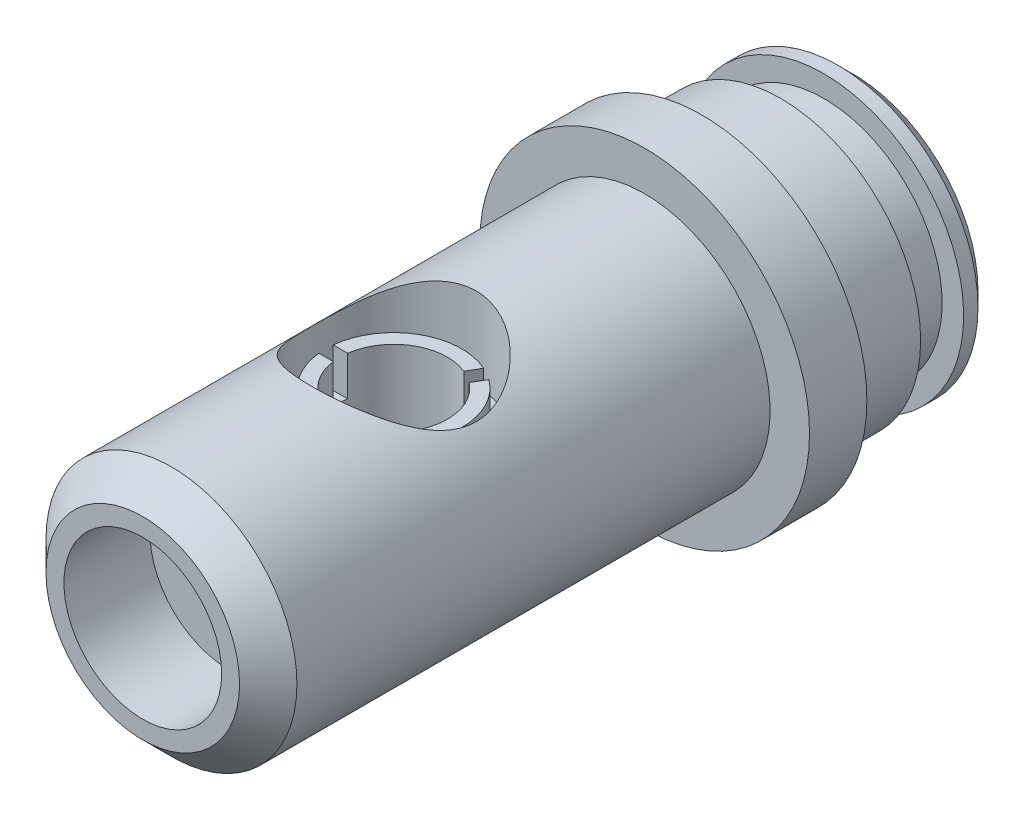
ISO-10303-21;
HEADER;
FILE_DESCRIPTION(('STEP AP214'),'2;1');
FILE_NAME('part.step','',(''),(''),'','','');
FILE_SCHEMA(('AUTOMOTIVE_DESIGN { 1 0 10303 214 1 1 1 1 }'));
ENDSEC;
DATA;
#1=APPLICATION_CONTEXT('core data for automotive mechanical design processes');
#2=APPLICATION_PROTOCOL_DEFINITION('international standard','automotive_design',2000,#1);
#3=PRODUCT_CONTEXT('',#1,'mechanical');
#4=PRODUCT('Part','Part','',(#3));
#5=PRODUCT_RELATED_PRODUCT_CATEGORY('part','',(#4));
#6=PRODUCT_DEFINITION_FORMATION('','',#4);
#7=PRODUCT_DEFINITION_CONTEXT('part definition',#1,'design');
#8=PRODUCT_DEFINITION('design','',#6,#7);
#9=PRODUCT_DEFINITION_SHAPE('','',#8);
#10=(LENGTH_UNIT() NAMED_UNIT(*) SI_UNIT(.MILLI.,.METRE.));
#11=(NAMED_UNIT(*) PLANE_ANGLE_UNIT() SI_UNIT($,.RADIAN.));
#12=(NAMED_UNIT(*) SI_UNIT($,.STERADIAN.) SOLID_ANGLE_UNIT());
#13=UNCERTAINTY_MEASURE_WITH_UNIT(LENGTH_MEASURE(1.E-05),#10,'distance_accuracy_value','');
#14=(GEOMETRIC_REPRESENTATION_CONTEXT(3) GLOBAL_UNCERTAINTY_ASSIGNED_CONTEXT((#13)) GLOBAL_UNIT_ASSIGNED_CONTEXT((#10,
#11,#12)) REPRESENTATION_CONTEXT('',''));
#15=CARTESIAN_POINT('',(0.,0.,0.));
#16=DIRECTION('',(0.,0.,1.));
#17=DIRECTION('',(1.,0.,0.));
#18=AXIS2_PLACEMENT_3D('',#15,#16,#17);
#19=CARTESIAN_POINT('',(0.,-100.,17.5));
#20=DIRECTION('',(0.,1.,0.));
#21=DIRECTION('',(0.,0.,1.));
#22=AXIS2_PLACEMENT_3D('',#19,#20,#21);
#23=CYLINDRICAL_SURFACE('',#22,3.75);
#24=CARTESIAN_POINT('',(0.,-8.75,21.25));
#25=CARTESIAN_POINT('',(0.100227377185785,-8.7499993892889,21.2499992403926));
#26=CARTESIAN_POINT('',(0.200485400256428,-8.74827314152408,21.2459761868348));
#27=CARTESIAN_POINT('',(0.400282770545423,-8.7414117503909,21.2299235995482));
#28=CARTESIAN_POINT('',(0.49982164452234,-8.73627453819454,21.2178892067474));
#29=CARTESIAN_POINT('',(0.69760374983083,-8.72271089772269,21.1859052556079));
#30=CARTESIAN_POINT('',(0.795844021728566,-8.7142779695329,21.1659400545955));
#31=CARTESIAN_POINT('',(0.990134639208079,-8.69434863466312,21.1183087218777));
#32=CARTESIAN_POINT('',(1.08618407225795,-8.68285097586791,21.0906394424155));
#33=CARTESIAN_POINT('',(1.3693125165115,-8.64427691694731,20.996689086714));
#34=CARTESIAN_POINT('',(1.55228472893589,-8.61305280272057,20.9193153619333));
#35=CARTESIAN_POINT('',(1.90236984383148,-8.54256906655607,20.7376630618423));
#36=CARTESIAN_POINT('',(2.06948702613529,-8.50331162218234,20.6333917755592));
#37=CARTESIAN_POINT('',(2.3922945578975,-8.41834800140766,20.3950897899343));
#38=CARTESIAN_POINT('',(2.54705184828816,-8.37242278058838,20.2598712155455));
#39=CARTESIAN_POINT('',(2.83248672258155,-8.28022159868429,19.9660798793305));
#40=CARTESIAN_POINT('',(2.9631509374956,-8.2339454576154,19.8074942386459));
#41=CARTESIAN_POINT('',(3.2035841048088,-8.14352157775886,19.461168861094));
#42=CARTESIAN_POINT('',(3.31188721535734,-8.09961488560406,19.272332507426));
#43=CARTESIAN_POINT('',(3.44900380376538,-8.04172417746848,18.9760651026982));
#44=CARTESIAN_POINT('',(3.49049730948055,-8.0237501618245,18.8750994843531));
#45=CARTESIAN_POINT('',(3.56465100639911,-7.99108303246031,18.6694795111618));
#46=CARTESIAN_POINT('',(3.59731581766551,-7.97638820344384,18.5648271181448));
#47=CARTESIAN_POINT('',(3.65203947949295,-7.9514757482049,18.3578992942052));
#48=CARTESIAN_POINT('',(3.67454443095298,-7.94107203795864,18.2557638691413));
#49=CARTESIAN_POINT('',(3.71096608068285,-7.92411735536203,18.0496994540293));
#50=CARTESIAN_POINT('',(3.72488681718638,-7.91756457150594,17.9457713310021));
#51=CARTESIAN_POINT('',(3.74397306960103,-7.90855725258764,17.7369672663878));
#52=CARTESIAN_POINT('',(3.74914116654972,-7.90610150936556,17.6320916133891));
#53=CARTESIAN_POINT('',(3.75066184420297,-7.90538023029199,17.4222664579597));
#54=CARTESIAN_POINT('',(3.74701493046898,-7.90711445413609,17.3173169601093));
#55=CARTESIAN_POINT('',(3.73161527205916,-7.91439277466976,17.1168517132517));
#56=CARTESIAN_POINT('',(3.72055440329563,-7.91961154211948,17.0212704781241));
#57=CARTESIAN_POINT('',(3.69117754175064,-7.93334495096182,16.8314590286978));
#58=CARTESIAN_POINT('',(3.67285907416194,-7.94186071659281,16.7372292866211));
#59=CARTESIAN_POINT('',(3.60727391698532,-7.97197945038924,16.4575723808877));
#60=CARTESIAN_POINT('',(3.54936451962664,-7.99816050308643,16.275013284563));
#61=CARTESIAN_POINT('',(3.40571679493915,-8.06038376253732,15.9184115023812));
#62=CARTESIAN_POINT('',(3.31939862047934,-8.09662874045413,15.7446416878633));
#63=CARTESIAN_POINT('',(3.12177987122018,-8.17485612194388,15.4133250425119));
#64=CARTESIAN_POINT('',(3.01046913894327,-8.21684085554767,15.2557848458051));
#65=CARTESIAN_POINT('',(2.754292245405,-8.30640507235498,14.946525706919));
#66=CARTESIAN_POINT('',(2.60730902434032,-8.35414819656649,14.7966034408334));
#67=CARTESIAN_POINT('',(2.28984174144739,-8.44668256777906,14.522911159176));
#68=CARTESIAN_POINT('',(2.11935154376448,-8.49147303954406,14.3991479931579));
#69=CARTESIAN_POINT('',(1.75398225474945,-8.574496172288,14.1784449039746));
#70=CARTESIAN_POINT('',(1.55858893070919,-8.61253068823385,14.0822761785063));
#71=CARTESIAN_POINT('',(1.15234962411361,-8.67621745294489,13.9248122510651));
#72=CARTESIAN_POINT('',(0.941512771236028,-8.70187695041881,13.8634966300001));
#73=CARTESIAN_POINT('',(0.525345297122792,-8.73654408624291,13.7813326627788));
#74=CARTESIAN_POINT('',(0.320572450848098,-8.74654062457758,13.7580765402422));
#75=CARTESIAN_POINT('',(-0.0901791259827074,-8.75194270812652,13.7454630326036));
#76=CARTESIAN_POINT('',(-0.296157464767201,-8.74735275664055,13.7560951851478));
#77=CARTESIAN_POINT('',(-0.691928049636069,-8.72473345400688,13.8092695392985));
#78=CARTESIAN_POINT('',(-0.88199866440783,-8.70743149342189,13.8500854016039));
#79=CARTESIAN_POINT('',(-1.25236392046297,-8.66192360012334,13.9600261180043));
#80=CARTESIAN_POINT('',(-1.43265734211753,-8.63371631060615,14.0291544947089));
#81=CARTESIAN_POINT('',(-1.78472120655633,-8.56798439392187,14.1960014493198));
#82=CARTESIAN_POINT('',(-1.95604968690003,-8.53019631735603,14.294545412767));
#83=CARTESIAN_POINT('',(-2.28035613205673,-8.44928735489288,14.5165236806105));
#84=CARTESIAN_POINT('',(-2.43332621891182,-8.40616419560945,14.6399686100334));
#85=CARTESIAN_POINT('',(-2.72870949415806,-8.31518485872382,14.919111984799));
#86=CARTESIAN_POINT('',(-2.86945771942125,-8.2672169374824,15.0765402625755));
#87=CARTESIAN_POINT('',(-3.12304289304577,-8.17480047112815,15.4134778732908));
#88=CARTESIAN_POINT('',(-3.23587208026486,-8.13035290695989,15.5929933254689));
#89=CARTESIAN_POINT('',(-3.43204844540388,-8.04953711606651,15.9735173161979));
#90=CARTESIAN_POINT('',(-3.51483018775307,-8.01332819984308,16.1748537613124));
#91=CARTESIAN_POINT('',(-3.64457356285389,-7.95517009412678,16.5906579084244));
#92=CARTESIAN_POINT('',(-3.6915670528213,-7.93320822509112,16.8051137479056));
#93=CARTESIAN_POINT('',(-3.74514935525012,-7.90804351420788,17.2224889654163));
#94=CARTESIAN_POINT('',(-3.75468366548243,-7.90347407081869,17.4249490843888));
#95=CARTESIAN_POINT('',(-3.74103311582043,-7.90994522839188,17.8284871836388));
#96=CARTESIAN_POINT('',(-3.71785402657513,-7.92098307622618,18.0295654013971));
#97=CARTESIAN_POINT('',(-3.64195539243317,-7.95614567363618,18.4138021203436));
#98=CARTESIAN_POINT('',(-3.59083719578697,-7.97955891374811,18.5973484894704));
#99=CARTESIAN_POINT('',(-3.46212777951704,-8.03623594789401,18.9532759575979));
#100=CARTESIAN_POINT('',(-3.38452903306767,-8.06950254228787,19.1256538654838));
#101=CARTESIAN_POINT('',(-3.19954063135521,-8.14469059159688,19.4660258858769));
#102=CARTESIAN_POINT('',(-3.09060290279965,-8.18702061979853,19.6330864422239));
#103=CARTESIAN_POINT('',(-2.84812001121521,-8.27449723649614,19.947477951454));
#104=CARTESIAN_POINT('',(-2.71456554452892,-8.31964488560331,20.0948014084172));
#105=CARTESIAN_POINT('',(-2.41418811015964,-8.41194280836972,20.3775045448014));
#106=CARTESIAN_POINT('',(-2.24557156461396,-8.45896999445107,20.5110244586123));
#107=CARTESIAN_POINT('',(-1.88649699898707,-8.54620596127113,20.7480496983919));
#108=CARTESIAN_POINT('',(-1.69602913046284,-8.58641164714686,20.8515414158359));
#109=CARTESIAN_POINT('',(-1.39943164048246,-8.63794303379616,20.9807408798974));
#110=CARTESIAN_POINT('',(-1.29946606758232,-8.65357999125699,21.0192916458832));
#111=CARTESIAN_POINT('',(-1.09621341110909,-8.68166502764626,21.0877977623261));
#112=CARTESIAN_POINT('',(-0.992927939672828,-8.69411462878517,21.1177572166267));
#113=CARTESIAN_POINT('',(-0.784082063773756,-8.71542974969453,21.1686846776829));
#114=CARTESIAN_POINT('',(-0.678527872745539,-8.72430400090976,21.189674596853));
#115=CARTESIAN_POINT('',(-0.465809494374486,-8.7382414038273,21.222510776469));
#116=CARTESIAN_POINT('',(-0.358646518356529,-8.74330728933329,21.2343635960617));
#117=CARTESIAN_POINT('',(-0.209366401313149,-8.74759504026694,21.2443855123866));
#118=CARTESIAN_POINT('',(-0.167527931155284,-8.74849631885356,21.2464902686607));
#119=CARTESIAN_POINT('',(-0.0837947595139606,-8.74969892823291,21.2492976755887));
#120=CARTESIAN_POINT('',(-0.0419000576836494,-8.75000025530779,21.2500003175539));
#121=CARTESIAN_POINT('',(0.,-8.75,21.25));
#122=B_SPLINE_CURVE_WITH_KNOTS('',3,(#24,#25,#26,#27,#28,#29,#30,#31,#32,#33,#34,#35,#36,#37,
#38,#39,#40,#41,#42,#43,#44,#45,#46,#47,#48,#49,#50,#51,#52,#53,#54,#55,#56,#57,#58,#59,#60,#61,
#62,#63,#64,#65,#66,#67,#68,#69,#70,#71,#72,#73,#74,#75,#76,#77,#78,#79,#80,#81,#82,#83,#84,#85,
#86,#87,#88,#89,#90,#91,#92,#93,#94,#95,#96,#97,#98,#99,#100,#101,#102,#103,#104,#105,#106,#107,
#108,#109,#110,#111,#112,#113,#114,#115,#116,#117,#118,#119,#120,#121),.UNSPECIFIED.,.T.,.F.,(4,
2,2,2,2,2,2,2,2,2,2,2,2,2,2,2,2,2,2,2,2,2,2,2,2,2,2,2,2,2,2,2,2,2,2,2,2,2,2,2,2,2,2,2,2,2,2,2,
4),(0.,0.300639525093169,0.601461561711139,0.902879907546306,1.20442158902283,1.80475703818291,
2.40492997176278,3.03390100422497,3.66322000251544,4.32573622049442,4.65724736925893,
4.98858470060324,5.30346943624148,5.6182059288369,5.93284959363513,6.24747521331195,
6.53620481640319,6.82503295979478,7.40220068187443,7.99196656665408,8.58197257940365,
9.22502192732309,9.86823944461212,10.5279895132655,11.1873526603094,11.8031157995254,
12.4186888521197,13.0015388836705,13.5844614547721,14.1855871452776,14.7869698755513,
15.4336845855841,16.0805788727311,16.7390825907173,17.3969994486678,18.0020050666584,
18.6069039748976,19.1802995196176,19.7538581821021,20.362958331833,20.9722891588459,
21.629701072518,22.2874104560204,22.6118791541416,22.9361926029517,23.2597091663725,
23.5829932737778,23.708674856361,23.8343572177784),.UNSPECIFIED.);
#123=CARTESIAN_POINT('',(0.,-8.75,21.25));
#124=VERTEX_POINT('',#123);
#125=EDGE_CURVE('E271',#124,#124,#122,.T.);
#126=ORIENTED_EDGE('',*,*,#125,.F.);
#127=EDGE_LOOP('',(#126));
#128=FACE_BOUND('',#127,.T.);
#129=DIRECTION('',(0.,1.,0.));
#130=VECTOR('',#129,1.);
#131=CARTESIAN_POINT('',(2.29127129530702,-100.,20.4685982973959));
#132=LINE('',#131,#130);
#133=CARTESIAN_POINT('',(2.29127129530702,5.75000000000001,20.4685982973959));
#134=VERTEX_POINT('',#133);
#135=CARTESIAN_POINT('',(2.29127129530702,3.,20.4685982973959));
#136=VERTEX_POINT('',#135);
#137=EDGE_CURVE('E219',#134,#136,#132,.F.);
#138=ORIENTED_EDGE('',*,*,#137,.F.);
#139=CARTESIAN_POINT('',(0.,5.75000000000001,17.5));
#140=DIRECTION('',(0.,1.,0.));
#141=DIRECTION('',(0.,0.,1.));
#142=AXIS2_PLACEMENT_3D('',#139,#140,#141);
#143=CIRCLE('',#142,3.75);
#144=CARTESIAN_POINT('',(2.29127129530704,5.75000000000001,14.5314017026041));
#145=VERTEX_POINT('',#144);
#146=EDGE_CURVE('E163',#145,#134,#143,.F.);
#147=ORIENTED_EDGE('',*,*,#146,.F.);
#148=DIRECTION('',(0.,1.,0.));
#149=VECTOR('',#148,1.);
#150=CARTESIAN_POINT('',(2.29127129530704,-100.,14.5314017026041));
#151=LINE('',#150,#149);
#152=CARTESIAN_POINT('',(2.29127129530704,3.,14.5314017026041));
#153=VERTEX_POINT('',#152);
#154=EDGE_CURVE('E56',#153,#145,#151,.T.);
#155=ORIENTED_EDGE('',*,*,#154,.F.);
#156=CARTESIAN_POINT('',(0.,3.,17.5));
#157=DIRECTION('',(0.,-1.,0.));
#158=DIRECTION('',(0.,0.,-1.));
#159=AXIS2_PLACEMENT_3D('',#156,#157,#158);
#160=CIRCLE('',#159,3.75);
#161=CARTESIAN_POINT('',(1.4252458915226,3.,14.0314017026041));
#162=VERTEX_POINT('',#161);
#163=EDGE_CURVE('E199',#153,#162,#160,.F.);
#164=ORIENTED_EDGE('',*,*,#163,.T.);
#165=DIRECTION('',(0.,1.,0.));
#166=VECTOR('',#165,1.);
#167=CARTESIAN_POINT('',(1.4252458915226,-100.,14.0314017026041));
#168=LINE('',#167,#166);
#169=CARTESIAN_POINT('',(1.4252458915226,5.75000000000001,14.0314017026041));
#170=VERTEX_POINT('',#169);
#171=EDGE_CURVE('E202',#170,#162,#168,.F.);
#172=ORIENTED_EDGE('',*,*,#171,.F.);
#173=CARTESIAN_POINT('',(-3.71651718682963,5.75000000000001,17.));
#174=VERTEX_POINT('',#173);
#175=EDGE_CURVE('E156',#174,#170,#143,.F.);
#176=ORIENTED_EDGE('',*,*,#175,.F.);
#177=DIRECTION('',(0.,1.,0.));
#178=VECTOR('',#177,1.);
#179=CARTESIAN_POINT('',(-3.71651718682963,-100.,17.));
#180=LINE('',#179,#178);
#181=CARTESIAN_POINT('',(-3.71651718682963,3.,17.));
#182=VERTEX_POINT('',#181);
#183=EDGE_CURVE('E190',#182,#174,#180,.T.);
#184=ORIENTED_EDGE('',*,*,#183,.F.);
#185=CARTESIAN_POINT('',(0.,3.,17.5));
#186=DIRECTION('',(0.,-1.,0.));
#187=DIRECTION('',(0.,0.,-1.));
#188=AXIS2_PLACEMENT_3D('',#185,#186,#187);
#189=CIRCLE('',#188,3.75);
#190=CARTESIAN_POINT('',(-3.71651718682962,3.,18.));
#191=VERTEX_POINT('',#190);
#192=EDGE_CURVE('E179',#182,#191,#189,.F.);
#193=ORIENTED_EDGE('',*,*,#192,.T.);
#194=DIRECTION('',(0.,1.,0.));
#195=VECTOR('',#194,1.);
#196=CARTESIAN_POINT('',(-3.71651718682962,-100.,18.));
#197=LINE('',#196,#195);
#198=CARTESIAN_POINT('',(-3.71651718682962,5.75000000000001,18.));
#199=VERTEX_POINT('',#198);
#200=EDGE_CURVE('E183',#199,#191,#197,.F.);
#201=ORIENTED_EDGE('',*,*,#200,.F.);
#202=CARTESIAN_POINT('',(1.42524589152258,5.75000000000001,20.9685982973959));
#203=VERTEX_POINT('',#202);
#204=EDGE_CURVE('E164',#203,#199,#143,.F.);
#205=ORIENTED_EDGE('',*,*,#204,.F.);
#206=DIRECTION('',(0.,1.,0.));
#207=VECTOR('',#206,1.);
#208=CARTESIAN_POINT('',(1.42524589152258,-100.,20.9685982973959));
#209=LINE('',#208,#207);
#210=CARTESIAN_POINT('',(1.42524589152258,3.,20.9685982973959));
#211=VERTEX_POINT('',#210);
#212=EDGE_CURVE('E48',#211,#203,#209,.T.);
#213=ORIENTED_EDGE('',*,*,#212,.F.);
#214=CARTESIAN_POINT('',(0.,3.,17.5));
#215=DIRECTION('',(0.,-1.,0.));
#216=DIRECTION('',(0.,0.,-1.));
#217=AXIS2_PLACEMENT_3D('',#214,#215,#216);
#218=CIRCLE('',#217,3.75);
#219=EDGE_CURVE('E142',#211,#136,#218,.F.);
#220=ORIENTED_EDGE('',*,*,#219,.T.);
#221=EDGE_LOOP('',(#138,#147,#155,#164,#172,#176,#184,#193,#201,#205,#213,#220));
#222=FACE_BOUND('',#221,.T.);
#223=ADVANCED_FACE('F32',(#128,#222),#23,.F.);
#224=CARTESIAN_POINT('',(0.,13.,17.5));
#225=DIRECTION('',(0.,-1.,0.));
#226=DIRECTION('',(0.,0.,-1.));
#227=AXIS2_PLACEMENT_3D('',#224,#225,#226);
#228=CYLINDRICAL_SURFACE('',#227,4.75);
#229=DIRECTION('',(0.,-1.,0.));
#230=VECTOR('',#229,1.);
#231=CARTESIAN_POINT('',(2.79481815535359,13.,21.3407670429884));
#232=LINE('',#231,#230);
#233=CARTESIAN_POINT('',(2.79481815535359,3.,21.3407670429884));
#234=VERTEX_POINT('',#233);
#235=CARTESIAN_POINT('',(2.79481815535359,5.75,21.3407670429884));
#236=VERTEX_POINT('',#235);
#237=EDGE_CURVE('E221',#234,#236,#232,.F.);
#238=ORIENTED_EDGE('',*,*,#237,.F.);
#239=CARTESIAN_POINT('',(0.,3.,17.5));
#240=DIRECTION('',(0.,1.,0.));
#241=DIRECTION('',(-1.,0.,0.));
#242=AXIS2_PLACEMENT_3D('',#239,#240,#241);
#243=CIRCLE('',#242,4.75);
#244=CARTESIAN_POINT('',(2.79481815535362,3.,13.6592329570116));
#245=VERTEX_POINT('',#244);
#246=EDGE_CURVE('E149',#234,#245,#243,.T.);
#247=ORIENTED_EDGE('',*,*,#246,.T.);
#248=DIRECTION('',(0.,-1.,0.));
#249=VECTOR('',#248,1.);
#250=CARTESIAN_POINT('',(2.79481815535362,13.,13.6592329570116));
#251=LINE('',#250,#249);
#252=CARTESIAN_POINT('',(2.79481815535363,5.75,13.6592329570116));
#253=VERTEX_POINT('',#252);
#254=EDGE_CURVE('E209',#253,#245,#251,.T.);
#255=ORIENTED_EDGE('',*,*,#254,.F.);
#256=CARTESIAN_POINT('',(0.,5.75,17.5));
#257=DIRECTION('',(0.,1.,0.));
#258=DIRECTION('',(0.,0.,1.));
#259=AXIS2_PLACEMENT_3D('',#256,#257,#258);
#260=CIRCLE('',#259,4.75);
#261=EDGE_CURVE('E175',#236,#253,#260,.T.);
#262=ORIENTED_EDGE('',*,*,#261,.F.);
#263=EDGE_LOOP('',(#238,#247,#255,#262));
#264=FACE_BOUND('',#263,.T.);
#265=ADVANCED_FACE('F234',(#264),#228,.T.);
#266=DIRECTION('',(0.,-1.,0.));
#267=VECTOR('',#266,1.);
#268=CARTESIAN_POINT('',(1.92879275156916,13.,21.8407670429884));
#269=LINE('',#268,#267);
#270=CARTESIAN_POINT('',(1.92879275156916,5.75,21.8407670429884));
#271=VERTEX_POINT('',#270);
#272=CARTESIAN_POINT('',(1.92879275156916,3.,21.8407670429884));
#273=VERTEX_POINT('',#272);
#274=EDGE_CURVE('E123',#271,#273,#269,.T.);
#275=ORIENTED_EDGE('',*,*,#274,.F.);
#276=CARTESIAN_POINT('',(-4.7236109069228,5.75,18.));
#277=VERTEX_POINT('',#276);
#278=EDGE_CURVE('E171',#277,#271,#260,.T.);
#279=ORIENTED_EDGE('',*,*,#278,.F.);
#280=DIRECTION('',(0.,-1.,0.));
#281=VECTOR('',#280,1.);
#282=CARTESIAN_POINT('',(-4.7236109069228,13.,18.));
#283=LINE('',#282,#281);
#284=CARTESIAN_POINT('',(-4.7236109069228,3.,18.));
#285=VERTEX_POINT('',#284);
#286=EDGE_CURVE('E147',#285,#277,#283,.F.);
#287=ORIENTED_EDGE('',*,*,#286,.F.);
#288=EDGE_CURVE('E139',#285,#273,#243,.T.);
#289=ORIENTED_EDGE('',*,*,#288,.T.);
#290=EDGE_LOOP('',(#275,#279,#287,#289));
#291=FACE_BOUND('',#290,.T.);
#292=ADVANCED_FACE('F146',(#291),#228,.T.);
#293=CARTESIAN_POINT('',(0.,5.75,17.5));
#294=DIRECTION('',(0.,1.,0.));
#295=DIRECTION('',(0.,0.,1.));
#296=AXIS2_PLACEMENT_3D('',#293,#294,#295);
#297=PLANE('',#296);
#298=ORIENTED_EDGE('',*,*,#146,.T.);
#299=DIRECTION('',(0.499999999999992,0.,0.866025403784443));
#300=VECTOR('',#299,1.);
#301=CARTESIAN_POINT('',(0.433012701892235,5.75,17.25));
#302=LINE('',#301,#300);
#303=EDGE_CURVE('E223',#134,#236,#302,.T.);
#304=ORIENTED_EDGE('',*,*,#303,.T.);
#305=ORIENTED_EDGE('',*,*,#261,.T.);
#306=DIRECTION('',(-0.500000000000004,0.,0.866025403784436));
#307=VECTOR('',#306,1.);
#308=CARTESIAN_POINT('',(0.433012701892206,5.75,17.75));
#309=LINE('',#308,#307);
#310=EDGE_CURVE('E212',#253,#145,#309,.T.);
#311=ORIENTED_EDGE('',*,*,#310,.T.);
#312=EDGE_LOOP('',(#298,#304,#305,#311));
#313=FACE_BOUND('',#312,.T.);
#314=ADVANCED_FACE('F242',(#313),#297,.T.);
#315=ORIENTED_EDGE('',*,*,#278,.T.);
#316=DIRECTION('',(-0.499999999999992,0.,-0.866025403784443));
#317=VECTOR('',#316,1.);
#318=CARTESIAN_POINT('',(-0.433012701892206,5.75,17.75));
#319=LINE('',#318,#317);
#320=EDGE_CURVE('E127',#271,#203,#319,.T.);
#321=ORIENTED_EDGE('',*,*,#320,.T.);
#322=ORIENTED_EDGE('',*,*,#204,.T.);
#323=DIRECTION('',(-1.,0.,0.));
#324=VECTOR('',#323,1.);
#325=CARTESIAN_POINT('',(0.,5.75,18.));
#326=LINE('',#325,#324);
#327=EDGE_CURVE('E12',#199,#277,#326,.T.);
#328=ORIENTED_EDGE('',*,*,#327,.T.);
#329=EDGE_LOOP('',(#315,#321,#322,#328));
#330=FACE_BOUND('',#329,.T.);
#331=ADVANCED_FACE('F244',(#330),#297,.T.);
#332=DIRECTION('',(0.,-1.,0.));
#333=VECTOR('',#332,1.);
#334=CARTESIAN_POINT('',(1.92879275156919,13.,13.1592329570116));
#335=LINE('',#334,#333);
#336=CARTESIAN_POINT('',(1.92879275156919,3.,13.1592329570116));
#337=VERTEX_POINT('',#336);
#338=CARTESIAN_POINT('',(1.92879275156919,5.75,13.1592329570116));
#339=VERTEX_POINT('',#338);
#340=EDGE_CURVE('E204',#337,#339,#335,.F.);
#341=ORIENTED_EDGE('',*,*,#340,.F.);
#342=CARTESIAN_POINT('',(-4.7236109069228,3.,17.));
#343=VERTEX_POINT('',#342);
#344=EDGE_CURVE('E151',#337,#343,#243,.T.);
#345=ORIENTED_EDGE('',*,*,#344,.T.);
#346=DIRECTION('',(0.,-1.,0.));
#347=VECTOR('',#346,1.);
#348=CARTESIAN_POINT('',(-4.7236109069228,13.,17.));
#349=LINE('',#348,#347);
#350=CARTESIAN_POINT('',(-4.7236109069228,5.75,17.));
#351=VERTEX_POINT('',#350);
#352=EDGE_CURVE('E192',#351,#343,#349,.T.);
#353=ORIENTED_EDGE('',*,*,#352,.F.);
#354=EDGE_CURVE('E177',#339,#351,#260,.T.);
#355=ORIENTED_EDGE('',*,*,#354,.F.);
#356=EDGE_LOOP('',(#341,#345,#353,#355));
#357=FACE_BOUND('',#356,.T.);
#358=ADVANCED_FACE('F251',(#357),#228,.T.);
#359=ORIENTED_EDGE('',*,*,#175,.T.);
#360=DIRECTION('',(0.500000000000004,0.,-0.866025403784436));
#361=VECTOR('',#360,1.);
#362=CARTESIAN_POINT('',(-0.433012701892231,5.75,17.25));
#363=LINE('',#362,#361);
#364=EDGE_CURVE('E206',#170,#339,#363,.T.);
#365=ORIENTED_EDGE('',*,*,#364,.T.);
#366=ORIENTED_EDGE('',*,*,#354,.T.);
#367=DIRECTION('',(1.,0.,0.));
#368=VECTOR('',#367,1.);
#369=CARTESIAN_POINT('',(0.,5.75,17.));
#370=LINE('',#369,#368);
#371=EDGE_CURVE('E41',#351,#174,#370,.T.);
#372=ORIENTED_EDGE('',*,*,#371,.T.);
#373=EDGE_LOOP('',(#359,#365,#366,#372));
#374=FACE_BOUND('',#373,.T.);
#375=ADVANCED_FACE('F246',(#374),#297,.T.);
#376=CARTESIAN_POINT('',(0.,0.,35.));
#377=DIRECTION('',(0.,0.,-1.));
#378=DIRECTION('',(-1.,0.,0.));
#379=AXIS2_PLACEMENT_3D('',#376,#377,#378);
#380=CYLINDRICAL_SURFACE('',#379,8.75);
#381=ORIENTED_EDGE('',*,*,#125,.T.);
#382=EDGE_LOOP('',(#381));
#383=FACE_BOUND('',#382,.T.);
#384=CARTESIAN_POINT('',(0.,0.,33.));
#385=DIRECTION('',(0.,0.,1.));
#386=DIRECTION('',(1.,0.,0.));
#387=AXIS2_PLACEMENT_3D('',#384,#385,#386);
#388=CIRCLE('',#387,8.75);
#389=CARTESIAN_POINT('',(8.75,0.,33.));
#390=VERTEX_POINT('',#389);
#391=EDGE_CURVE('E300',#390,#390,#388,.F.);
#392=ORIENTED_EDGE('',*,*,#391,.T.);
#393=EDGE_LOOP('',(#392));
#394=FACE_BOUND('',#393,.T.);
#395=CARTESIAN_POINT('',(0.,0.,0.));
#396=DIRECTION('',(0.,0.,-1.));
#397=DIRECTION('',(-1.,0.,0.));
#398=AXIS2_PLACEMENT_3D('',#395,#396,#397);
#399=CIRCLE('',#398,8.75);
#400=CARTESIAN_POINT('',(-8.75,0.,0.));
#401=VERTEX_POINT('',#400);
#402=EDGE_CURVE('E303',#401,#401,#399,.T.);
#403=ORIENTED_EDGE('',*,*,#402,.F.);
#404=EDGE_LOOP('',(#403));
#405=FACE_BOUND('',#404,.T.);
#406=CARTESIAN_POINT('',(0.,8.75,11.75));
#407=CARTESIAN_POINT('',(-0.144848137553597,8.74999944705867,11.7500005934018));
#408=CARTESIAN_POINT('',(-0.289705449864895,8.74639520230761,11.7554810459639));
#409=CARTESIAN_POINT('',(-0.57824610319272,8.73206754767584,11.7773196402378));
#410=CARTESIAN_POINT('',(-0.721929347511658,8.72134355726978,11.7936786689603));
#411=CARTESIAN_POINT('',(-1.00704393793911,8.69303703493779,11.837035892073));
#412=CARTESIAN_POINT('',(-1.14847445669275,8.67545204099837,11.8640379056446));
#413=CARTESIAN_POINT('',(-1.42806466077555,8.63383581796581,11.9283108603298));
#414=CARTESIAN_POINT('',(-1.56622297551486,8.60980193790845,11.9655860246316));
#415=CARTESIAN_POINT('',(-1.8376234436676,8.55597302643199,12.0497050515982));
#416=CARTESIAN_POINT('',(-1.97088738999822,8.52620854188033,12.0964982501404));
#417=CARTESIAN_POINT('',(-2.23254924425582,8.4614670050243,12.1992446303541));
#418=CARTESIAN_POINT('',(-2.36094523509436,8.42648792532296,12.2552013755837));
#419=CARTESIAN_POINT('',(-2.73779680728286,8.31477268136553,12.4359621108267));
#420=CARTESIAN_POINT('',(-2.97815668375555,8.23120889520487,12.5737323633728));
#421=CARTESIAN_POINT('',(-3.45255771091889,8.04442803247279,12.8923036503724));
#422=CARTESIAN_POINT('',(-3.68438265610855,7.94015097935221,13.0757426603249));
#423=CARTESIAN_POINT('',(-4.11619360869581,7.72512941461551,13.4743455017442));
#424=CARTESIAN_POINT('',(-4.31613396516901,7.61437593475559,13.689553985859));
#425=CARTESIAN_POINT('',(-4.60405216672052,7.44179629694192,14.0512645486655));
#426=CARTESIAN_POINT('',(-4.70360049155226,7.3791022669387,14.1882935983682));
#427=CARTESIAN_POINT('',(-4.89072473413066,7.25643405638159,14.4714443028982));
#428=CARTESIAN_POINT('',(-4.97829804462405,7.19646047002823,14.6175679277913));
#429=CARTESIAN_POINT('',(-5.22179198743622,7.02387239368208,15.0685822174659));
#430=CARTESIAN_POINT('',(-5.35907108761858,6.91822239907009,15.3868456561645));
#431=CARTESIAN_POINT('',(-5.5451572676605,6.76933273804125,15.9583445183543));
#432=CARTESIAN_POINT('',(-5.60799708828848,6.7168949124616,16.204601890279));
#433=CARTESIAN_POINT('',(-5.67758473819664,6.657957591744,16.5813753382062));
#434=CARTESIAN_POINT('',(-5.69666616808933,6.64160073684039,16.7081506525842));
#435=CARTESIAN_POINT('',(-5.72635034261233,6.61602702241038,16.9634315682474));
#436=CARTESIAN_POINT('',(-5.73695302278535,6.60681021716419,17.0919371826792));
#437=CARTESIAN_POINT('',(-5.7495068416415,6.59588798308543,17.3501739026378));
#438=CARTESIAN_POINT('',(-5.75142537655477,6.59421086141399,17.4799077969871));
#439=CARTESIAN_POINT('',(-5.74648941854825,6.59851271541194,17.7390793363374));
#440=CARTESIAN_POINT('',(-5.73963488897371,6.6044917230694,17.8685169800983));
#441=CARTESIAN_POINT('',(-5.71726858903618,6.62386277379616,18.1261501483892));
#442=CARTESIAN_POINT('',(-5.70175217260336,6.63725879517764,18.2543449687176));
#443=CARTESIAN_POINT('',(-5.66232430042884,6.67092537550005,18.5085407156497));
#444=CARTESIAN_POINT('',(-5.63840932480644,6.69119881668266,18.6345406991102));
#445=CARTESIAN_POINT('',(-5.55676566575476,6.75942307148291,18.9982855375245));
#446=CARTESIAN_POINT('',(-5.48817467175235,6.81567322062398,19.2321343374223));
#447=CARTESIAN_POINT('',(-5.32408741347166,6.94459525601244,19.6851336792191));
#448=CARTESIAN_POINT('',(-5.22858231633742,7.01727253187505,19.9042793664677));
#449=CARTESIAN_POINT('',(-4.99150098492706,7.18838106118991,20.3684945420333));
#450=CARTESIAN_POINT('',(-4.84452995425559,7.28905569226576,20.6099768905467));
#451=CARTESIAN_POINT('',(-4.51807053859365,7.49579168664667,21.0677257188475));
#452=CARTESIAN_POINT('',(-4.33854245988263,7.60185951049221,21.2839608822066));
#453=CARTESIAN_POINT('',(-4.02676804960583,7.76951738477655,21.6080646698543));
#454=CARTESIAN_POINT('',(-3.90411720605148,7.83201818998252,21.7248268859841));
#455=CARTESIAN_POINT('',(-3.64825872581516,7.95441959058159,21.9476363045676));
#456=CARTESIAN_POINT('',(-3.5150543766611,8.01432098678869,22.0536868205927));
#457=CARTESIAN_POINT('',(-3.23864213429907,8.1299530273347,22.254244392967));
#458=CARTESIAN_POINT('',(-3.09543971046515,8.18568591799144,22.34875768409));
#459=CARTESIAN_POINT('',(-2.79961686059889,8.29151979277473,22.5253654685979));
#460=CARTESIAN_POINT('',(-2.64699906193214,8.34162233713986,22.6074634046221));
#461=CARTESIAN_POINT('',(-2.36421461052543,8.42557111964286,22.743329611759));
#462=CARTESIAN_POINT('',(-2.23556560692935,8.46067378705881,22.7994907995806));
#463=CARTESIAN_POINT('',(-1.97336072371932,8.52564244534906,22.9026089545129));
#464=CARTESIAN_POINT('',(-1.83980583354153,8.5555094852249,22.9495677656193));
#465=CARTESIAN_POINT('',(-1.56858765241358,8.60936318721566,23.0337310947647));
#466=CARTESIAN_POINT('',(-1.43092698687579,8.63335352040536,23.0709417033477));
#467=CARTESIAN_POINT('',(-1.15228881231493,8.67493917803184,23.1351725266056));
#468=CARTESIAN_POINT('',(-1.01131124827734,8.69253439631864,23.1621925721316));
#469=CARTESIAN_POINT('',(-0.726481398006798,8.72096832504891,23.2057481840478));
#470=CARTESIAN_POINT('',(-0.582619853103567,8.73177966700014,23.2222412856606));
#471=CARTESIAN_POINT('',(-0.293701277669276,8.74626545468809,23.2443214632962));
#472=CARTESIAN_POINT('',(-0.148644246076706,8.74993989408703,23.2499085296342));
#473=CARTESIAN_POINT('',(0.141479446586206,8.75005863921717,23.2500892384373));
#474=CARTESIAN_POINT('',(0.286546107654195,8.7465029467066,23.2446828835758));
#475=CARTESIAN_POINT('',(0.575498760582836,8.73225211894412,23.222961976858));
#476=CARTESIAN_POINT('',(0.719384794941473,8.72155724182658,23.2066478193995));
#477=CARTESIAN_POINT('',(0.995677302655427,8.69420135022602,23.1647482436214));
#478=CARTESIAN_POINT('',(1.1282273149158,8.67796786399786,23.1398259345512));
#479=CARTESIAN_POINT('',(1.39049350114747,8.639827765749,23.0809603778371));
#480=CARTESIAN_POINT('',(1.52020869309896,8.61791922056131,23.0470140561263));
#481=CARTESIAN_POINT('',(1.9038655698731,8.54431994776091,22.9322106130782));
#482=CARTESIAN_POINT('',(2.15254356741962,8.48473224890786,22.8383541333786));
#483=CARTESIAN_POINT('',(2.64648798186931,8.34439681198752,22.6124648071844));
#484=CARTESIAN_POINT('',(2.89044970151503,8.26251343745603,22.4783238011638));
#485=CARTESIAN_POINT('',(3.35339431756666,8.085710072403,22.1790263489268));
#486=CARTESIAN_POINT('',(3.57236012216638,7.99078125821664,22.0138488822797));
#487=CARTESIAN_POINT('',(4.01523086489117,7.7788012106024,21.6279284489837));
#488=CARTESIAN_POINT('',(4.2345325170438,7.66061442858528,21.4025342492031));
#489=CARTESIAN_POINT('',(4.63418511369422,7.42566568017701,20.918384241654));
#490=CARTESIAN_POINT('',(4.81451537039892,7.30890450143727,20.6596108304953));
#491=CARTESIAN_POINT('',(5.04445590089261,7.15006911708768,20.2633348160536));
#492=CARTESIAN_POINT('',(5.111247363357,7.10236820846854,20.137809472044));
#493=CARTESIAN_POINT('',(5.23585821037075,7.01100864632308,19.8808961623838));
#494=CARTESIAN_POINT('',(5.293676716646,6.96735038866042,19.7495076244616));
#495=CARTESIAN_POINT('',(5.39972072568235,6.88549232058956,19.4814793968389));
#496=CARTESIAN_POINT('',(5.44795899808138,6.84728526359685,19.3448469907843));
#497=CARTESIAN_POINT('',(5.53433020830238,6.77766698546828,19.0667983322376));
#498=CARTESIAN_POINT('',(5.57246926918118,6.74625164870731,18.9253850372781));
#499=CARTESIAN_POINT('',(5.632733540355,6.69597578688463,18.6618916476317));
#500=CARTESIAN_POINT('',(5.65645420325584,6.67590446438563,18.5404063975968));
#501=CARTESIAN_POINT('',(5.69608036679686,6.64212687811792,18.2953383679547));
#502=CARTESIAN_POINT('',(5.71198956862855,6.62841760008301,18.1717566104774));
#503=CARTESIAN_POINT('',(5.73575276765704,6.6078656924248,17.9233211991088));
#504=CARTESIAN_POINT('',(5.74361148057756,6.60101904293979,17.7984683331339));
#505=CARTESIAN_POINT('',(5.75115840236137,6.59444477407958,17.5483245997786));
#506=CARTESIAN_POINT('',(5.75084645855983,6.59471728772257,17.423033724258));
#507=CARTESIAN_POINT('',(5.74205647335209,6.60237262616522,17.1730081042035));
#508=CARTESIAN_POINT('',(5.73358185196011,6.60975247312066,17.0482731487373));
#509=CARTESIAN_POINT('',(5.70861845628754,6.63132195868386,16.8001834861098));
#510=CARTESIAN_POINT('',(5.69212682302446,6.64551402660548,16.6768292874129));
#511=CARTESIAN_POINT('',(5.63095142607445,6.69760112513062,16.309918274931));
#512=CARTESIAN_POINT('',(5.5745694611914,6.74500480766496,16.0695735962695));
#513=CARTESIAN_POINT('',(5.41338205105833,6.8754022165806,15.536351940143));
#514=CARTESIAN_POINT('',(5.29939714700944,6.96466673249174,15.247812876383));
#515=CARTESIAN_POINT('',(5.0976451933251,7.11220719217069,14.8354089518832));
#516=CARTESIAN_POINT('',(5.02517037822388,7.16372439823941,14.7012077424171));
#517=CARTESIAN_POINT('',(4.87042769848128,7.26981774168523,14.4398556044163));
#518=CARTESIAN_POINT('',(4.78816036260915,7.32439371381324,14.3127042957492));
#519=CARTESIAN_POINT('',(4.52436417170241,7.49242275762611,13.9381328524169));
#520=CARTESIAN_POINT('',(4.32801205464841,7.60851384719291,13.7020103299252));
#521=CARTESIAN_POINT('',(4.00672690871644,7.77968369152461,13.3729944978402));
#522=CARTESIAN_POINT('',(3.89511589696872,7.83627073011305,13.2674752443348));
#523=CARTESIAN_POINT('',(3.66313872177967,7.94735328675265,13.0651844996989));
#524=CARTESIAN_POINT('',(3.54277064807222,8.00184834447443,12.9684149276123));
#525=CARTESIAN_POINT('',(3.27883942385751,8.11385508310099,12.7732927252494));
#526=CARTESIAN_POINT('',(3.13422132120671,8.17095270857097,12.6761249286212));
#527=CARTESIAN_POINT('',(2.83523964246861,8.27944351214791,12.4945548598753));
#528=CARTESIAN_POINT('',(2.68088086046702,8.3308394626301,12.4101463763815));
#529=CARTESIAN_POINT('',(2.36345176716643,8.42638907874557,12.2552172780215));
#530=CARTESIAN_POINT('',(2.20039303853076,8.47055207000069,12.1846787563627));
#531=CARTESIAN_POINT('',(1.86662146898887,8.55029964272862,12.0584911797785));
#532=CARTESIAN_POINT('',(1.6959119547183,8.58588791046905,12.0028357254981));
#533=CARTESIAN_POINT('',(1.39949774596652,8.63825517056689,11.9214599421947));
#534=CARTESIAN_POINT('',(1.27530483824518,8.65748844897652,11.8917487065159));
#535=CARTESIAN_POINT('',(1.02455111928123,8.69072940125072,11.8405690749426));
#536=CARTESIAN_POINT('',(0.897990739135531,8.70473801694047,11.8190991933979));
#537=CARTESIAN_POINT('',(0.643255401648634,8.72726015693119,11.7846487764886));
#538=CARTESIAN_POINT('',(0.515080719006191,8.73577460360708,11.7716668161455));
#539=CARTESIAN_POINT('',(0.257939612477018,8.74714390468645,11.7543434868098));
#540=CARTESIAN_POINT('',(0.128973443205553,8.75000049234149,11.7499994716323));
#541=CARTESIAN_POINT('',(0.,8.75,11.75));
#542=B_SPLINE_CURVE_WITH_KNOTS('',3,(#406,#407,#408,#409,#410,#411,#412,#413,#414,#415,#416,
#417,#418,#419,#420,#421,#422,#423,#424,#425,#426,#427,#428,#429,#430,#431,#432,#433,#434,#435,
#436,#437,#438,#439,#440,#441,#442,#443,#444,#445,#446,#447,#448,#449,#450,#451,#452,#453,#454,
#455,#456,#457,#458,#459,#460,#461,#462,#463,#464,#465,#466,#467,#468,#469,#470,#471,#472,#473,
#474,#475,#476,#477,#478,#479,#480,#481,#482,#483,#484,#485,#486,#487,#488,#489,#490,#491,#492,
#493,#494,#495,#496,#497,#498,#499,#500,#501,#502,#503,#504,#505,#506,#507,#508,#509,#510,#511,
#512,#513,#514,#515,#516,#517,#518,#519,#520,#521,#522,#523,#524,#525,#526,#527,#528,#529,#530,
#531,#532,#533,#534,#535,#536,#537,#538,#539,#540,#541),.UNSPECIFIED.,.T.,.F.,(4,2,2,2,2,2,2,2,
2,2,2,2,2,2,2,2,2,2,2,2,2,2,2,2,2,2,2,2,2,2,2,2,2,2,2,2,2,2,2,2,2,2,2,2,2,2,2,2,2,2,2,2,2,2,2,2,
2,2,2,2,2,2,2,2,2,2,2,4),(0.,0.434413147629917,0.868861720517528,1.30346633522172,
1.73824987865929,2.1707769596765,2.60347264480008,3.46810106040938,4.40516276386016,
5.34355429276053,5.88476791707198,6.42609918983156,7.5057858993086,8.28094088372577,
8.66823903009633,9.05554012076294,9.44429409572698,9.83304969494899,10.2220140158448,
10.6111415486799,11.3584443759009,12.105992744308,13.0031242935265,13.9013570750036,
14.4423219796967,14.9831190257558,15.523622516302,16.063975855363,16.4976279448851,
16.9311930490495,17.3644866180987,17.797787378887,18.2328251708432,18.6678633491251,
19.1029014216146,19.5379237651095,19.9449926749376,20.352200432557,21.1659371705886,
22.0332971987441,22.9012468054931,23.9052118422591,24.9097085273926,25.3592990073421,
25.8089334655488,26.2579645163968,26.7067226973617,27.082519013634,27.4581370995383,
27.8335350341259,28.2089399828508,28.5841877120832,28.9595693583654,29.7105122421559,
30.673571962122,31.1561464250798,31.6386948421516,32.6192191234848,33.1099247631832,
33.6007377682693,34.1500230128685,34.6990399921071,35.2473434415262,35.7954107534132,
36.1824675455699,36.5694545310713,36.9563765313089,37.3431799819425),.UNSPECIFIED.);
#543=CARTESIAN_POINT('',(0.,8.75,11.75));
#544=VERTEX_POINT('',#543);
#545=EDGE_CURVE('E153',#544,#544,#542,.T.);
#546=ORIENTED_EDGE('',*,*,#545,.F.);
#547=EDGE_LOOP('',(#546));
#548=FACE_BOUND('',#547,.T.);
#549=ADVANCED_FACE('F34',(#383,#394,#405,#548),#380,.T.);
#550=CARTESIAN_POINT('',(0.,0.,-14.5));
#551=DIRECTION('',(0.,0.,1.));
#552=DIRECTION('',(1.,0.,0.));
#553=AXIS2_PLACEMENT_3D('',#550,#551,#552);
#554=CYLINDRICAL_SURFACE('',#553,9.75);
#555=CARTESIAN_POINT('',(0.,0.,-4.));
#556=DIRECTION('',(0.,0.,-1.));
#557=DIRECTION('',(-1.,0.,0.));
#558=AXIS2_PLACEMENT_3D('',#555,#556,#557);
#559=CIRCLE('',#558,9.75);
#560=CARTESIAN_POINT('',(9.75,0.,-4.));
#561=VERTEX_POINT('',#560);
#562=EDGE_CURVE('E346',#561,#561,#559,.T.);
#563=CARTESIAN_POINT('',(0.,0.,-9.5));
#564=DIRECTION('',(0.,0.,-1.));
#565=DIRECTION('',(-1.,0.,0.));
#566=AXIS2_PLACEMENT_3D('',#563,#564,#565);
#567=CIRCLE('',#566,9.75);
#568=CARTESIAN_POINT('',(9.75,0.,-9.5));
#569=VERTEX_POINT('',#568);
#570=EDGE_CURVE('E321',#569,#569,#567,.T.);
#571=CARTESIAN_POINT('',(9.75,0.,-4.));
#572=CARTESIAN_POINT('',(9.75,0.,-4.05729166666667));
#573=CARTESIAN_POINT('',(9.75,0.,-4.11458333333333));
#574=CARTESIAN_POINT('',(9.75,0.,-4.22916666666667));
#575=CARTESIAN_POINT('',(9.75,0.,-4.28645833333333));
#576=CARTESIAN_POINT('',(9.75,0.,-4.40104166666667));
#577=CARTESIAN_POINT('',(9.75,0.,-4.45833333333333));
#578=CARTESIAN_POINT('',(9.75,0.,-4.57291666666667));
#579=CARTESIAN_POINT('',(9.75,0.,-4.63020833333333));
#580=CARTESIAN_POINT('',(9.75,0.,-4.74479166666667));
#581=CARTESIAN_POINT('',(9.75,0.,-4.80208333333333));
#582=CARTESIAN_POINT('',(9.75,0.,-4.91666666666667));
#583=CARTESIAN_POINT('',(9.75,0.,-4.97395833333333));
#584=CARTESIAN_POINT('',(9.75,0.,-5.08854166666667));
#585=CARTESIAN_POINT('',(9.75,0.,-5.14583333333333));
#586=CARTESIAN_POINT('',(9.75,0.,-5.26041666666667));
#587=CARTESIAN_POINT('',(9.75,0.,-5.31770833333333));
#588=CARTESIAN_POINT('',(9.75,0.,-5.43229166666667));
#589=CARTESIAN_POINT('',(9.75,0.,-5.48958333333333));
#590=CARTESIAN_POINT('',(9.75,0.,-5.60416666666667));
#591=CARTESIAN_POINT('',(9.75,0.,-5.66145833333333));
#592=CARTESIAN_POINT('',(9.75,0.,-5.77604166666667));
#593=CARTESIAN_POINT('',(9.75,0.,-5.83333333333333));
#594=CARTESIAN_POINT('',(9.75,0.,-5.94791666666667));
#595=CARTESIAN_POINT('',(9.75,0.,-6.00520833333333));
#596=CARTESIAN_POINT('',(9.75,0.,-6.11979166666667));
#597=CARTESIAN_POINT('',(9.75,0.,-6.17708333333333));
#598=CARTESIAN_POINT('',(9.75,0.,-6.29166666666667));
#599=CARTESIAN_POINT('',(9.75,0.,-6.34895833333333));
#600=CARTESIAN_POINT('',(9.75,0.,-6.46354166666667));
#601=CARTESIAN_POINT('',(9.75,0.,-6.52083333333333));
#602=CARTESIAN_POINT('',(9.75,0.,-6.63541666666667));
#603=CARTESIAN_POINT('',(9.75,0.,-6.69270833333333));
#604=CARTESIAN_POINT('',(9.75,0.,-6.80729166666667));
#605=CARTESIAN_POINT('',(9.75,0.,-6.86458333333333));
#606=CARTESIAN_POINT('',(9.75,0.,-6.97916666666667));
#607=CARTESIAN_POINT('',(9.75,0.,-7.03645833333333));
#608=CARTESIAN_POINT('',(9.75,0.,-7.15104166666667));
#609=CARTESIAN_POINT('',(9.75,0.,-7.20833333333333));
#610=CARTESIAN_POINT('',(9.75,0.,-7.32291666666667));
#611=CARTESIAN_POINT('',(9.75,0.,-7.38020833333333));
#612=CARTESIAN_POINT('',(9.75,0.,-7.49479166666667));
#613=CARTESIAN_POINT('',(9.75,0.,-7.55208333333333));
#614=CARTESIAN_POINT('',(9.75,0.,-7.66666666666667));
#615=CARTESIAN_POINT('',(9.75,0.,-7.72395833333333));
#616=CARTESIAN_POINT('',(9.75,0.,-7.83854166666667));
#617=CARTESIAN_POINT('',(9.75,0.,-7.89583333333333));
#618=CARTESIAN_POINT('',(9.75,0.,-8.01041666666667));
#619=CARTESIAN_POINT('',(9.75,0.,-8.06770833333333));
#620=CARTESIAN_POINT('',(9.75,0.,-8.18229166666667));
#621=CARTESIAN_POINT('',(9.75,0.,-8.23958333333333));
#622=CARTESIAN_POINT('',(9.75,0.,-8.35416666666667));
#623=CARTESIAN_POINT('',(9.75,0.,-8.41145833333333));
#624=CARTESIAN_POINT('',(9.75,0.,-8.52604166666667));
#625=CARTESIAN_POINT('',(9.75,0.,-8.58333333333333));
#626=CARTESIAN_POINT('',(9.75,0.,-8.69791666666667));
#627=CARTESIAN_POINT('',(9.75,0.,-8.75520833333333));
#628=CARTESIAN_POINT('',(9.75,0.,-8.86979166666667));
#629=CARTESIAN_POINT('',(9.75,0.,-8.92708333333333));
#630=CARTESIAN_POINT('',(9.75,0.,-9.04166666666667));
#631=CARTESIAN_POINT('',(9.75,0.,-9.09895833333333));
#632=CARTESIAN_POINT('',(9.75,0.,-9.21354166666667));
#633=CARTESIAN_POINT('',(9.75,0.,-9.27083333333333));
#634=CARTESIAN_POINT('',(9.75,0.,-9.38541666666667));
#635=CARTESIAN_POINT('',(9.75,0.,-9.44270833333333));
#636=CARTESIAN_POINT('',(9.75,0.,-9.5));
#637=B_SPLINE_CURVE_WITH_KNOTS('',3,(#571,#572,#573,#574,#575,#576,#577,#578,#579,#580,#581,
#582,#583,#584,#585,#586,#587,#588,#589,#590,#591,#592,#593,#594,#595,#596,#597,#598,#599,#600,
#601,#602,#603,#604,#605,#606,#607,#608,#609,#610,#611,#612,#613,#614,#615,#616,#617,#618,#619,
#620,#621,#622,#623,#624,#625,#626,#627,#628,#629,#630,#631,#632,#633,#634,#635,#636),
.UNSPECIFIED.,.F.,.F.,(4,2,2,2,2,2,2,2,2,2,2,2,2,2,2,2,2,2,2,2,2,2,2,2,2,2,2,2,2,2,2,2,4),(0.,
0.171875,0.34375,0.515625,0.687500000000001,0.859375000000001,1.03125,1.203125,1.375,1.546875,
1.71875,1.890625,2.0625,2.234375,2.40625,2.578125,2.75,2.921875,3.09375,3.265625,3.4375,
3.609375,3.78125,3.953125,4.125,4.296875,4.46875,4.640625,4.8125,4.984375,5.15625,5.328125,5.5),.UNSPECIFIED.);
#638=EDGE_CURVE('BSEAM287',#561,#569,#637,.T.);
#639=ORIENTED_EDGE('',*,*,#562,.T.);
#640=ORIENTED_EDGE('',*,*,#570,.F.);
#641=ORIENTED_EDGE('',*,*,#638,.T.);
#642=ORIENTED_EDGE('',*,*,#638,.F.);
#643=EDGE_LOOP('',(#639,#641,#640,#642));
#644=FACE_BOUND('',#643,.T.);
#645=ADVANCED_FACE('F287',(#644),#554,.T.);
#646=CARTESIAN_POINT('',(0.,0.,-4.));
#647=DIRECTION('',(0.,0.,-1.));
#648=DIRECTION('',(-1.,0.,0.));
#649=AXIS2_PLACEMENT_3D('',#646,#647,#648);
#650=PLANE('',#649);
#651=CARTESIAN_POINT('',(0.,0.,-4.));
#652=DIRECTION('',(0.,0.,-1.));
#653=DIRECTION('',(-1.,0.,0.));
#654=AXIS2_PLACEMENT_3D('',#651,#652,#653);
#655=CIRCLE('',#654,11.5);
#656=CARTESIAN_POINT('',(-11.5,0.,-4.));
#657=VERTEX_POINT('',#656);
#658=EDGE_CURVE('E306',#657,#657,#655,.T.);
#659=ORIENTED_EDGE('',*,*,#658,.T.);
#660=EDGE_LOOP('',(#659));
#661=FACE_BOUND('',#660,.T.);
#662=ORIENTED_EDGE('',*,*,#562,.F.);
#663=EDGE_LOOP('',(#662));
#664=FACE_BOUND('',#663,.T.);
#665=ADVANCED_FACE('F292',(#661,#664),#650,.T.);
#666=CARTESIAN_POINT('',(0.,0.,35.));
#667=DIRECTION('',(0.,0.,1.));
#668=DIRECTION('',(1.,0.,0.));
#669=AXIS2_PLACEMENT_3D('',#666,#667,#668);
#670=PLANE('',#669);
#671=CARTESIAN_POINT('',(0.,0.,35.));
#672=DIRECTION('',(0.,0.,1.));
#673=DIRECTION('',(1.,0.,0.));
#674=AXIS2_PLACEMENT_3D('',#671,#672,#673);
#675=CIRCLE('',#674,5.5);
#676=CARTESIAN_POINT('',(5.5,0.,35.));
#677=VERTEX_POINT('',#676);
#678=EDGE_CURVE('E340',#677,#677,#675,.T.);
#679=ORIENTED_EDGE('',*,*,#678,.F.);
#680=EDGE_LOOP('',(#679));
#681=FACE_BOUND('',#680,.T.);
#682=CARTESIAN_POINT('',(0.,0.,35.));
#683=DIRECTION('',(0.,0.,1.));
#684=DIRECTION('',(1.,0.,0.));
#685=AXIS2_PLACEMENT_3D('',#682,#683,#684);
#686=CIRCLE('',#685,6.74999999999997);
#687=CARTESIAN_POINT('',(6.74999999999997,0.,35.));
#688=VERTEX_POINT('',#687);
#689=EDGE_CURVE('E317',#688,#688,#686,.T.);
#690=ORIENTED_EDGE('',*,*,#689,.T.);
#691=EDGE_LOOP('',(#690));
#692=FACE_BOUND('',#691,.T.);
#693=ADVANCED_FACE('F355',(#681,#692),#670,.T.);
#694=CARTESIAN_POINT('',(0.,0.,0.));
#695=DIRECTION('',(0.,0.,-1.));
#696=DIRECTION('',(-1.,0.,0.));
#697=AXIS2_PLACEMENT_3D('',#694,#695,#696);
#698=PLANE('',#697);
#699=CARTESIAN_POINT('',(0.,0.,0.));
#700=DIRECTION('',(0.,0.,-1.));
#701=DIRECTION('',(-1.,0.,0.));
#702=AXIS2_PLACEMENT_3D('',#699,#700,#701);
#703=CIRCLE('',#702,11.5);
#704=CARTESIAN_POINT('',(-11.5,0.,0.));
#705=VERTEX_POINT('',#704);
#706=EDGE_CURVE('E312',#705,#705,#703,.T.);
#707=ORIENTED_EDGE('',*,*,#706,.F.);
#708=EDGE_LOOP('',(#707));
#709=FACE_BOUND('',#708,.T.);
#710=ORIENTED_EDGE('',*,*,#402,.T.);
#711=EDGE_LOOP('',(#710));
#712=FACE_BOUND('',#711,.T.);
#713=ADVANCED_FACE('F353',(#709,#712),#698,.F.);
#714=CARTESIAN_POINT('',(0.,0.,-4.));
#715=DIRECTION('',(0.,0.,1.));
#716=DIRECTION('',(1.,0.,0.));
#717=AXIS2_PLACEMENT_3D('',#714,#715,#716);
#718=CYLINDRICAL_SURFACE('',#717,11.5);
#719=ORIENTED_EDGE('',*,*,#658,.F.);
#720=EDGE_LOOP('',(#719));
#721=FACE_BOUND('',#720,.T.);
#722=ORIENTED_EDGE('',*,*,#706,.T.);
#723=EDGE_LOOP('',(#722));
#724=FACE_BOUND('',#723,.T.);
#725=ADVANCED_FACE('F351',(#721,#724),#718,.T.);
#726=CARTESIAN_POINT('',(0.,0.,35.));
#727=DIRECTION('',(0.,0.,-1.));
#728=DIRECTION('',(-1.,0.,0.));
#729=AXIS2_PLACEMENT_3D('',#726,#727,#728);
#730=CONICAL_SURFACE('',#729,6.74999999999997,0.785398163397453);
#731=ORIENTED_EDGE('',*,*,#391,.F.);
#732=EDGE_LOOP('',(#731));
#733=FACE_BOUND('',#732,.T.);
#734=ORIENTED_EDGE('',*,*,#689,.F.);
#735=EDGE_LOOP('',(#734));
#736=FACE_BOUND('',#735,.T.);
#737=ADVANCED_FACE('F361',(#733,#736),#730,.T.);
#738=CARTESIAN_POINT('',(0.,0.,29.));
#739=DIRECTION('',(0.,0.,1.));
#740=DIRECTION('',(1.,0.,0.));
#741=AXIS2_PLACEMENT_3D('',#738,#739,#740);
#742=CYLINDRICAL_SURFACE('',#741,5.5);
#743=CARTESIAN_POINT('',(0.,0.,29.));
#744=DIRECTION('',(0.,0.,1.));
#745=DIRECTION('',(1.,0.,0.));
#746=AXIS2_PLACEMENT_3D('',#743,#744,#745);
#747=CIRCLE('',#746,5.5);
#748=CARTESIAN_POINT('',(5.5,0.,29.));
#749=VERTEX_POINT('',#748);
#750=EDGE_CURVE('E343',#749,#749,#747,.T.);
#751=ORIENTED_EDGE('',*,*,#750,.F.);
#752=EDGE_LOOP('',(#751));
#753=FACE_BOUND('',#752,.T.);
#754=ORIENTED_EDGE('',*,*,#678,.T.);
#755=EDGE_LOOP('',(#754));
#756=FACE_BOUND('',#755,.T.);
#757=ADVANCED_FACE('F394',(#753,#756),#742,.F.);
#758=CARTESIAN_POINT('',(0.,0.,29.));
#759=DIRECTION('',(0.,0.,1.));
#760=DIRECTION('',(1.,0.,0.));
#761=AXIS2_PLACEMENT_3D('',#758,#759,#760);
#762=PLANE('',#761);
#763=ORIENTED_EDGE('',*,*,#750,.T.);
#764=EDGE_LOOP('',(#763));
#765=FACE_BOUND('',#764,.T.);
#766=ADVANCED_FACE('F397',(#765),#762,.T.);
#767=CARTESIAN_POINT('',(0.,0.,-12.5));
#768=DIRECTION('',(0.,0.,-1.));
#769=DIRECTION('',(-1.,0.,0.));
#770=AXIS2_PLACEMENT_3D('',#767,#768,#769);
#771=PLANE('',#770);
#772=CARTESIAN_POINT('',(0.,0.,-12.5));
#773=DIRECTION('',(0.,0.,-1.));
#774=DIRECTION('',(-1.,0.,0.));
#775=AXIS2_PLACEMENT_3D('',#772,#773,#774);
#776=CIRCLE('',#775,8.25);
#777=CARTESIAN_POINT('',(-8.25,0.,-12.5));
#778=VERTEX_POINT('',#777);
#779=EDGE_CURVE('E323',#778,#778,#776,.T.);
#780=ORIENTED_EDGE('',*,*,#779,.T.);
#781=EDGE_LOOP('',(#780));
#782=FACE_BOUND('',#781,.T.);
#783=CARTESIAN_POINT('',(0.,0.,-12.5));
#784=DIRECTION('',(0.,0.,-1.));
#785=DIRECTION('',(-1.,0.,0.));
#786=AXIS2_PLACEMENT_3D('',#783,#784,#785);
#787=CIRCLE('',#786,9.75);
#788=CARTESIAN_POINT('',(9.75,0.,-12.5));
#789=VERTEX_POINT('',#788);
#790=EDGE_CURVE('E277',#789,#789,#787,.T.);
#791=ORIENTED_EDGE('',*,*,#790,.F.);
#792=EDGE_LOOP('',(#791));
#793=FACE_BOUND('',#792,.T.);
#794=ADVANCED_FACE('F406',(#782,#793),#771,.F.);
#795=CARTESIAN_POINT('',(0.,0.,-9.5));
#796=DIRECTION('',(0.,0.,-1.));
#797=DIRECTION('',(-1.,0.,0.));
#798=AXIS2_PLACEMENT_3D('',#795,#796,#797);
#799=PLANE('',#798);
#800=CARTESIAN_POINT('',(0.,0.,-9.5));
#801=DIRECTION('',(0.,0.,-1.));
#802=DIRECTION('',(-1.,0.,0.));
#803=AXIS2_PLACEMENT_3D('',#800,#801,#802);
#804=CIRCLE('',#803,8.25);
#805=CARTESIAN_POINT('',(-8.25,0.,-9.5));
#806=VERTEX_POINT('',#805);
#807=EDGE_CURVE('E276',#806,#806,#804,.T.);
#808=ORIENTED_EDGE('',*,*,#807,.F.);
#809=EDGE_LOOP('',(#808));
#810=FACE_BOUND('',#809,.T.);
#811=ORIENTED_EDGE('',*,*,#570,.T.);
#812=EDGE_LOOP('',(#811));
#813=FACE_BOUND('',#812,.T.);
#814=ADVANCED_FACE('F420',(#810,#813),#799,.T.);
#815=CARTESIAN_POINT('',(0.,0.,-12.5));
#816=DIRECTION('',(0.,0.,1.));
#817=DIRECTION('',(1.,0.,0.));
#818=AXIS2_PLACEMENT_3D('',#815,#816,#817);
#819=CYLINDRICAL_SURFACE('',#818,8.25);
#820=ORIENTED_EDGE('',*,*,#779,.F.);
#821=EDGE_LOOP('',(#820));
#822=FACE_BOUND('',#821,.T.);
#823=ORIENTED_EDGE('',*,*,#807,.T.);
#824=EDGE_LOOP('',(#823));
#825=FACE_BOUND('',#824,.T.);
#826=ADVANCED_FACE('F268',(#822,#825),#819,.T.);
#827=CARTESIAN_POINT('',(0.,0.,8.5));
#828=DIRECTION('',(0.,0.,-1.));
#829=DIRECTION('',(-1.,0.,0.));
#830=AXIS2_PLACEMENT_3D('',#827,#828,#829);
#831=PLANE('',#830);
#832=CARTESIAN_POINT('',(0.,0.,8.5));
#833=DIRECTION('',(0.,0.,-1.));
#834=DIRECTION('',(-1.,0.,0.));
#835=AXIS2_PLACEMENT_3D('',#832,#833,#834);
#836=CIRCLE('',#835,6.);
#837=CARTESIAN_POINT('',(-6.,0.,8.5));
#838=VERTEX_POINT('',#837);
#839=EDGE_CURVE('E337',#838,#838,#836,.T.);
#840=ORIENTED_EDGE('',*,*,#839,.T.);
#841=EDGE_LOOP('',(#840));
#842=FACE_BOUND('',#841,.T.);
#843=ADVANCED_FACE('F433',(#842),#831,.T.);
#844=CARTESIAN_POINT('',(0.,0.,8.5));
#845=DIRECTION('',(0.,0.,-1.));
#846=DIRECTION('',(-1.,0.,0.));
#847=AXIS2_PLACEMENT_3D('',#844,#845,#846);
#848=CYLINDRICAL_SURFACE('',#847,6.);
#849=ORIENTED_EDGE('',*,*,#839,.F.);
#850=EDGE_LOOP('',(#849));
#851=FACE_BOUND('',#850,.T.);
#852=CARTESIAN_POINT('',(0.,0.,-14.5));
#853=DIRECTION('',(0.,0.,-1.));
#854=DIRECTION('',(-1.,0.,0.));
#855=AXIS2_PLACEMENT_3D('',#852,#853,#854);
#856=CIRCLE('',#855,6.);
#857=CARTESIAN_POINT('',(-6.,0.,-14.5));
#858=VERTEX_POINT('',#857);
#859=EDGE_CURVE('E327',#858,#858,#856,.T.);
#860=ORIENTED_EDGE('',*,*,#859,.T.);
#861=EDGE_LOOP('',(#860));
#862=FACE_BOUND('',#861,.T.);
#863=ADVANCED_FACE('F440',(#851,#862),#848,.F.);
#864=CARTESIAN_POINT('',(0.,0.,-14.5));
#865=DIRECTION('',(0.,0.,-1.));
#866=DIRECTION('',(-1.,0.,0.));
#867=AXIS2_PLACEMENT_3D('',#864,#865,#866);
#868=PLANE('',#867);
#869=ORIENTED_EDGE('',*,*,#859,.F.);
#870=EDGE_LOOP('',(#869));
#871=FACE_BOUND('',#870,.T.);
#872=CARTESIAN_POINT('',(0.,0.,-14.5));
#873=DIRECTION('',(0.,0.,-1.));
#874=DIRECTION('',(-1.,0.,0.));
#875=AXIS2_PLACEMENT_3D('',#872,#873,#874);
#876=CIRCLE('',#875,8.74999999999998);
#877=CARTESIAN_POINT('',(-8.74999999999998,0.,-14.5));
#878=VERTEX_POINT('',#877);
#879=EDGE_CURVE('E305',#878,#878,#876,.T.);
#880=ORIENTED_EDGE('',*,*,#879,.T.);
#881=EDGE_LOOP('',(#880));
#882=FACE_BOUND('',#881,.T.);
#883=ADVANCED_FACE('F447',(#871,#882),#868,.T.);
#884=CARTESIAN_POINT('',(0.,0.,-14.5));
#885=DIRECTION('',(0.,0.,1.));
#886=DIRECTION('',(1.,0.,0.));
#887=AXIS2_PLACEMENT_3D('',#884,#885,#886);
#888=CONICAL_SURFACE('',#887,8.74999999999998,0.785398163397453);
#889=CARTESIAN_POINT('',(0.,0.,-13.5));
#890=DIRECTION('',(0.,0.,-1.));
#891=DIRECTION('',(-1.,0.,0.));
#892=AXIS2_PLACEMENT_3D('',#889,#890,#891);
#893=CIRCLE('',#892,9.75);
#894=CARTESIAN_POINT('',(9.75,0.,-13.5));
#895=VERTEX_POINT('',#894);
#896=EDGE_CURVE('E309',#895,#895,#893,.F.);
#897=ORIENTED_EDGE('',*,*,#896,.F.);
#898=EDGE_LOOP('',(#897));
#899=FACE_BOUND('',#898,.T.);
#900=ORIENTED_EDGE('',*,*,#879,.F.);
#901=EDGE_LOOP('',(#900));
#902=FACE_BOUND('',#901,.T.);
#903=ADVANCED_FACE('F455',(#899,#902),#888,.T.);
#904=CARTESIAN_POINT('',(9.75,0.,-12.5));
#905=CARTESIAN_POINT('',(9.75,0.,-12.5104166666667));
#906=CARTESIAN_POINT('',(9.75,0.,-12.5208333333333));
#907=CARTESIAN_POINT('',(9.75,0.,-12.5416666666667));
#908=CARTESIAN_POINT('',(9.75,0.,-12.5520833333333));
#909=CARTESIAN_POINT('',(9.75,0.,-12.5729166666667));
#910=CARTESIAN_POINT('',(9.75,0.,-12.5833333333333));
#911=CARTESIAN_POINT('',(9.75,0.,-12.6041666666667));
#912=CARTESIAN_POINT('',(9.75,0.,-12.6145833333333));
#913=CARTESIAN_POINT('',(9.75,0.,-12.6354166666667));
#914=CARTESIAN_POINT('',(9.75,0.,-12.6458333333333));
#915=CARTESIAN_POINT('',(9.75,0.,-12.6666666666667));
#916=CARTESIAN_POINT('',(9.75,0.,-12.6770833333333));
#917=CARTESIAN_POINT('',(9.75,0.,-12.6979166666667));
#918=CARTESIAN_POINT('',(9.75,0.,-12.7083333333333));
#919=CARTESIAN_POINT('',(9.75,0.,-12.7291666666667));
#920=CARTESIAN_POINT('',(9.75,0.,-12.7395833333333));
#921=CARTESIAN_POINT('',(9.75,0.,-12.7604166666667));
#922=CARTESIAN_POINT('',(9.75,0.,-12.7708333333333));
#923=CARTESIAN_POINT('',(9.75,0.,-12.7916666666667));
#924=CARTESIAN_POINT('',(9.75,0.,-12.8020833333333));
#925=CARTESIAN_POINT('',(9.75,0.,-12.8229166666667));
#926=CARTESIAN_POINT('',(9.75,0.,-12.8333333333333));
#927=CARTESIAN_POINT('',(9.75,0.,-12.8541666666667));
#928=CARTESIAN_POINT('',(9.75,0.,-12.8645833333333));
#929=CARTESIAN_POINT('',(9.75,0.,-12.8854166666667));
#930=CARTESIAN_POINT('',(9.75,0.,-12.8958333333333));
#931=CARTESIAN_POINT('',(9.75,0.,-12.9166666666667));
#932=CARTESIAN_POINT('',(9.75,0.,-12.9270833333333));
#933=CARTESIAN_POINT('',(9.75,0.,-12.9479166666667));
#934=CARTESIAN_POINT('',(9.75,0.,-12.9583333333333));
#935=CARTESIAN_POINT('',(9.75,0.,-12.9791666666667));
#936=CARTESIAN_POINT('',(9.75,0.,-12.9895833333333));
#937=CARTESIAN_POINT('',(9.75,0.,-13.0104166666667));
#938=CARTESIAN_POINT('',(9.75,0.,-13.0208333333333));
#939=CARTESIAN_POINT('',(9.75,0.,-13.0416666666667));
#940=CARTESIAN_POINT('',(9.75,0.,-13.0520833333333));
#941=CARTESIAN_POINT('',(9.75,0.,-13.0729166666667));
#942=CARTESIAN_POINT('',(9.75,0.,-13.0833333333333));
#943=CARTESIAN_POINT('',(9.75,0.,-13.1041666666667));
#944=CARTESIAN_POINT('',(9.75,0.,-13.1145833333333));
#945=CARTESIAN_POINT('',(9.75,0.,-13.1354166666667));
#946=CARTESIAN_POINT('',(9.75,0.,-13.1458333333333));
#947=CARTESIAN_POINT('',(9.75,0.,-13.1666666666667));
#948=CARTESIAN_POINT('',(9.75,0.,-13.1770833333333));
#949=CARTESIAN_POINT('',(9.75,0.,-13.1979166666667));
#950=CARTESIAN_POINT('',(9.75,0.,-13.2083333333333));
#951=CARTESIAN_POINT('',(9.75,0.,-13.2291666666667));
#952=CARTESIAN_POINT('',(9.75,0.,-13.2395833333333));
#953=CARTESIAN_POINT('',(9.75,0.,-13.2604166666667));
#954=CARTESIAN_POINT('',(9.75,0.,-13.2708333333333));
#955=CARTESIAN_POINT('',(9.75,0.,-13.2916666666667));
#956=CARTESIAN_POINT('',(9.75,0.,-13.3020833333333));
#957=CARTESIAN_POINT('',(9.75,0.,-13.3229166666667));
#958=CARTESIAN_POINT('',(9.75,0.,-13.3333333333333));
#959=CARTESIAN_POINT('',(9.75,0.,-13.3541666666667));
#960=CARTESIAN_POINT('',(9.75,0.,-13.3645833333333));
#961=CARTESIAN_POINT('',(9.75,0.,-13.3854166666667));
#962=CARTESIAN_POINT('',(9.75,0.,-13.3958333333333));
#963=CARTESIAN_POINT('',(9.75,0.,-13.4166666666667));
#964=CARTESIAN_POINT('',(9.75,0.,-13.4270833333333));
#965=CARTESIAN_POINT('',(9.75,0.,-13.4479166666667));
#966=CARTESIAN_POINT('',(9.75,0.,-13.4583333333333));
#967=CARTESIAN_POINT('',(9.75,0.,-13.4791666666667));
#968=CARTESIAN_POINT('',(9.75,0.,-13.4895833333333));
#969=CARTESIAN_POINT('',(9.75,0.,-13.5));
#970=B_SPLINE_CURVE_WITH_KNOTS('',3,(#904,#905,#906,#907,#908,#909,#910,#911,#912,#913,#914,
#915,#916,#917,#918,#919,#920,#921,#922,#923,#924,#925,#926,#927,#928,#929,#930,#931,#932,#933,
#934,#935,#936,#937,#938,#939,#940,#941,#942,#943,#944,#945,#946,#947,#948,#949,#950,#951,#952,
#953,#954,#955,#956,#957,#958,#959,#960,#961,#962,#963,#964,#965,#966,#967,#968,#969),
.UNSPECIFIED.,.F.,.F.,(4,2,2,2,2,2,2,2,2,2,2,2,2,2,2,2,2,2,2,2,2,2,2,2,2,2,2,2,2,2,2,2,4),(0.,
0.03125,0.0625000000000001,0.0937500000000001,0.125,0.156249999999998,0.187499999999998,
0.218749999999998,0.249999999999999,0.281249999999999,0.312499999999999,0.343749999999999,
0.374999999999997,0.406249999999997,0.437499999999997,0.468749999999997,0.499999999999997,
0.531249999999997,0.562499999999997,0.593749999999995,0.624999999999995,0.656249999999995,
0.687499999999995,0.718749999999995,0.749999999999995,0.781249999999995,0.812499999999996,
0.843749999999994,0.874999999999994,0.906249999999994,0.937499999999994,0.968749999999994,
0.999999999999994),.UNSPECIFIED.);
#971=EDGE_CURVE('BSEAM295',#789,#895,#970,.T.);
#972=ORIENTED_EDGE('',*,*,#790,.T.);
#973=ORIENTED_EDGE('',*,*,#896,.T.);
#974=ORIENTED_EDGE('',*,*,#971,.T.);
#975=ORIENTED_EDGE('',*,*,#971,.F.);
#976=EDGE_LOOP('',(#972,#974,#973,#975));
#977=FACE_BOUND('',#976,.T.);
#978=ADVANCED_FACE('F295',(#977),#554,.T.);
#979=CARTESIAN_POINT('',(0.,13.,17.5));
#980=DIRECTION('',(0.,-1.,0.));
#981=DIRECTION('',(0.,0.,-1.));
#982=AXIS2_PLACEMENT_3D('',#979,#980,#981);
#983=CYLINDRICAL_SURFACE('',#982,5.75);
#984=ORIENTED_EDGE('',*,*,#545,.T.);
#985=EDGE_LOOP('',(#984));
#986=FACE_BOUND('',#985,.T.);
#987=CARTESIAN_POINT('',(0.,3.,17.5));
#988=DIRECTION('',(0.,1.,0.));
#989=DIRECTION('',(0.,0.,1.));
#990=AXIS2_PLACEMENT_3D('',#987,#988,#989);
#991=CIRCLE('',#990,5.75);
#992=CARTESIAN_POINT('',(0.,3.,23.25));
#993=VERTEX_POINT('',#992);
#994=EDGE_CURVE('E148',#993,#993,#991,.T.);
#995=ORIENTED_EDGE('',*,*,#994,.F.);
#996=EDGE_LOOP('',(#995));
#997=FACE_BOUND('',#996,.T.);
#998=ADVANCED_FACE('F265',(#986,#997),#983,.F.);
#999=CARTESIAN_POINT('',(0.,3.,17.5));
#1000=DIRECTION('',(0.,1.,0.));
#1001=DIRECTION('',(0.,0.,1.));
#1002=AXIS2_PLACEMENT_3D('',#999,#1000,#1001);
#1003=PLANE('',#1002);
#1004=ORIENTED_EDGE('',*,*,#246,.F.);
#1005=DIRECTION('',(0.499999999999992,0.,0.866025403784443));
#1006=VECTOR('',#1005,1.);
#1007=CARTESIAN_POINT('',(1.93301270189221,3.,19.8480762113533));
#1008=LINE('',#1007,#1006);
#1009=EDGE_CURVE('E143',#136,#234,#1008,.T.);
#1010=ORIENTED_EDGE('',*,*,#1009,.F.);
#1011=ORIENTED_EDGE('',*,*,#219,.F.);
#1012=DIRECTION('',(-0.499999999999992,0.,-0.866025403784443));
#1013=VECTOR('',#1012,1.);
#1014=CARTESIAN_POINT('',(2.06698729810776,3.,22.0801270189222));
#1015=LINE('',#1014,#1013);
#1016=EDGE_CURVE('E126',#273,#211,#1015,.T.);
#1017=ORIENTED_EDGE('',*,*,#1016,.F.);
#1018=ORIENTED_EDGE('',*,*,#288,.F.);
#1019=DIRECTION('',(-1.,0.,0.));
#1020=VECTOR('',#1019,1.);
#1021=CARTESIAN_POINT('',(-3.,3.,18.));
#1022=LINE('',#1021,#1020);
#1023=EDGE_CURVE('E194',#191,#285,#1022,.T.);
#1024=ORIENTED_EDGE('',*,*,#1023,.F.);
#1025=ORIENTED_EDGE('',*,*,#192,.F.);
#1026=DIRECTION('',(1.,0.,0.));
#1027=VECTOR('',#1026,1.);
#1028=CARTESIAN_POINT('',(-5.00000000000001,3.,17.));
#1029=LINE('',#1028,#1027);
#1030=EDGE_CURVE('E196',#343,#182,#1029,.T.);
#1031=ORIENTED_EDGE('',*,*,#1030,.F.);
#1032=ORIENTED_EDGE('',*,*,#344,.F.);
#1033=DIRECTION('',(0.500000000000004,0.,-0.866025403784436));
#1034=VECTOR('',#1033,1.);
#1035=CARTESIAN_POINT('',(1.06698729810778,3.,14.6519237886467));
#1036=LINE('',#1035,#1034);
#1037=EDGE_CURVE('E214',#162,#337,#1036,.T.);
#1038=ORIENTED_EDGE('',*,*,#1037,.F.);
#1039=ORIENTED_EDGE('',*,*,#163,.F.);
#1040=DIRECTION('',(-0.500000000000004,0.,0.866025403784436));
#1041=VECTOR('',#1040,1.);
#1042=CARTESIAN_POINT('',(2.93301270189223,3.,13.4198729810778));
#1043=LINE('',#1042,#1041);
#1044=EDGE_CURVE('E216',#245,#153,#1043,.T.);
#1045=ORIENTED_EDGE('',*,*,#1044,.F.);
#1046=EDGE_LOOP('',(#1004,#1010,#1011,#1017,#1018,#1024,#1025,#1031,#1032,#1038,#1039,#1045));
#1047=FACE_BOUND('',#1046,.T.);
#1048=ORIENTED_EDGE('',*,*,#994,.T.);
#1049=EDGE_LOOP('',(#1048));
#1050=FACE_BOUND('',#1049,.T.);
#1051=ADVANCED_FACE('F136',(#1047,#1050),#1003,.T.);
#1052=CARTESIAN_POINT('',(-3.,3.,18.));
#1053=DIRECTION('',(0.,0.,-1.));
#1054=DIRECTION('',(-1.,0.,0.));
#1055=AXIS2_PLACEMENT_3D('',#1052,#1053,#1054);
#1056=PLANE('',#1055);
#1057=ORIENTED_EDGE('',*,*,#200,.T.);
#1058=ORIENTED_EDGE('',*,*,#1023,.T.);
#1059=ORIENTED_EDGE('',*,*,#286,.T.);
#1060=ORIENTED_EDGE('',*,*,#327,.F.);
#1061=EDGE_LOOP('',(#1057,#1058,#1059,#1060));
#1062=FACE_BOUND('',#1061,.T.);
#1063=ADVANCED_FACE('F479',(#1062),#1056,.T.);
#1064=CARTESIAN_POINT('',(-5.00000000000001,3.,17.));
#1065=DIRECTION('',(0.,0.,1.));
#1066=DIRECTION('',(1.,0.,0.));
#1067=AXIS2_PLACEMENT_3D('',#1064,#1065,#1066);
#1068=PLANE('',#1067);
#1069=ORIENTED_EDGE('',*,*,#183,.T.);
#1070=ORIENTED_EDGE('',*,*,#371,.F.);
#1071=ORIENTED_EDGE('',*,*,#352,.T.);
#1072=ORIENTED_EDGE('',*,*,#1030,.T.);
#1073=EDGE_LOOP('',(#1069,#1070,#1071,#1072));
#1074=FACE_BOUND('',#1073,.T.);
#1075=ADVANCED_FACE('F487',(#1074),#1068,.T.);
#1076=CARTESIAN_POINT('',(1.06698729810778,3.,14.6519237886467));
#1077=DIRECTION('',(0.866025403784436,0.,0.500000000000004));
#1078=DIRECTION('',(0.500000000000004,0.,-0.866025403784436));
#1079=AXIS2_PLACEMENT_3D('',#1076,#1077,#1078);
#1080=PLANE('',#1079);
#1081=ORIENTED_EDGE('',*,*,#171,.T.);
#1082=ORIENTED_EDGE('',*,*,#1037,.T.);
#1083=ORIENTED_EDGE('',*,*,#340,.T.);
#1084=ORIENTED_EDGE('',*,*,#364,.F.);
#1085=EDGE_LOOP('',(#1081,#1082,#1083,#1084));
#1086=FACE_BOUND('',#1085,.T.);
#1087=ADVANCED_FACE('F495',(#1086),#1080,.T.);
#1088=CARTESIAN_POINT('',(2.93301270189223,3.,13.4198729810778));
#1089=DIRECTION('',(-0.866025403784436,0.,-0.500000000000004));
#1090=DIRECTION('',(-0.500000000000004,0.,0.866025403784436));
#1091=AXIS2_PLACEMENT_3D('',#1088,#1089,#1090);
#1092=PLANE('',#1091);
#1093=ORIENTED_EDGE('',*,*,#154,.T.);
#1094=ORIENTED_EDGE('',*,*,#310,.F.);
#1095=ORIENTED_EDGE('',*,*,#254,.T.);
#1096=ORIENTED_EDGE('',*,*,#1044,.T.);
#1097=EDGE_LOOP('',(#1093,#1094,#1095,#1096));
#1098=FACE_BOUND('',#1097,.T.);
#1099=ADVANCED_FACE('F238',(#1098),#1092,.T.);
#1100=CARTESIAN_POINT('',(1.93301270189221,3.,19.8480762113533));
#1101=DIRECTION('',(-0.866025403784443,0.,0.499999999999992));
#1102=DIRECTION('',(0.499999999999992,0.,0.866025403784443));
#1103=AXIS2_PLACEMENT_3D('',#1100,#1101,#1102);
#1104=PLANE('',#1103);
#1105=ORIENTED_EDGE('',*,*,#137,.T.);
#1106=ORIENTED_EDGE('',*,*,#1009,.T.);
#1107=ORIENTED_EDGE('',*,*,#237,.T.);
#1108=ORIENTED_EDGE('',*,*,#303,.F.);
#1109=EDGE_LOOP('',(#1105,#1106,#1107,#1108));
#1110=FACE_BOUND('',#1109,.T.);
#1111=ADVANCED_FACE('F230',(#1110),#1104,.T.);
#1112=CARTESIAN_POINT('',(2.06698729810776,3.,22.0801270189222));
#1113=DIRECTION('',(0.866025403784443,0.,-0.499999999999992));
#1114=DIRECTION('',(-0.499999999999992,0.,-0.866025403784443));
#1115=AXIS2_PLACEMENT_3D('',#1112,#1113,#1114);
#1116=PLANE('',#1115);
#1117=ORIENTED_EDGE('',*,*,#212,.T.);
#1118=ORIENTED_EDGE('',*,*,#320,.F.);
#1119=ORIENTED_EDGE('',*,*,#274,.T.);
#1120=ORIENTED_EDGE('',*,*,#1016,.T.);
#1121=EDGE_LOOP('',(#1117,#1118,#1119,#1120));
#1122=FACE_BOUND('',#1121,.T.);
#1123=ADVANCED_FACE('F125',(#1122),#1116,.T.);
#1124=CLOSED_SHELL('',(#223,#265,#292,#314,#331,#358,#375,#549,#645,#665,#693,#713,#725,#737,
#757,#766,#794,#814,#826,#843,#863,#883,#903,#978,#998,#1051,#1063,#1075,#1087,#1099,#1111,#1123));
#1125=MANIFOLD_SOLID_BREP('B2',#1124);
#1126=ADVANCED_BREP_SHAPE_REPRESENTATION('',(#18,#1125),#14);
#1127=SHAPE_DEFINITION_REPRESENTATION(#9,#1126);
ENDSEC;
END-ISO-10303-21;
